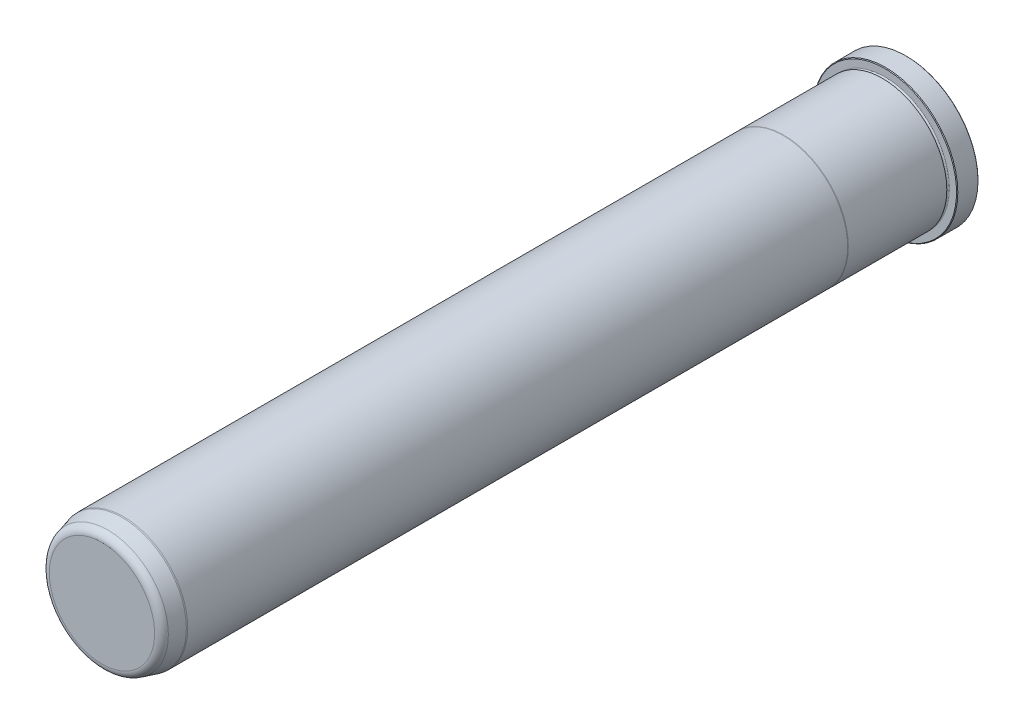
ISO-10303-21;
HEADER;
FILE_DESCRIPTION(('STEP AP214'),'2;1');
FILE_NAME('part.step','',(''),(''),'','','');
FILE_SCHEMA(('AUTOMOTIVE_DESIGN { 1 0 10303 214 1 1 1 1 }'));
ENDSEC;
DATA;
#1=APPLICATION_CONTEXT('core data for automotive mechanical design processes');
#2=APPLICATION_PROTOCOL_DEFINITION('international standard','automotive_design',2000,#1);
#3=PRODUCT_CONTEXT('',#1,'mechanical');
#4=PRODUCT('Part','Part','',(#3));
#5=PRODUCT_RELATED_PRODUCT_CATEGORY('part','',(#4));
#6=PRODUCT_DEFINITION_FORMATION('','',#4);
#7=PRODUCT_DEFINITION_CONTEXT('part definition',#1,'design');
#8=PRODUCT_DEFINITION('design','',#6,#7);
#9=PRODUCT_DEFINITION_SHAPE('','',#8);
#10=(LENGTH_UNIT() NAMED_UNIT(*) SI_UNIT(.MILLI.,.METRE.));
#11=(NAMED_UNIT(*) PLANE_ANGLE_UNIT() SI_UNIT($,.RADIAN.));
#12=(NAMED_UNIT(*) SI_UNIT($,.STERADIAN.) SOLID_ANGLE_UNIT());
#13=UNCERTAINTY_MEASURE_WITH_UNIT(LENGTH_MEASURE(1.E-05),#10,'distance_accuracy_value','');
#14=(GEOMETRIC_REPRESENTATION_CONTEXT(3) GLOBAL_UNCERTAINTY_ASSIGNED_CONTEXT((#13)) GLOBAL_UNIT_ASSIGNED_CONTEXT((#10,
#11,#12)) REPRESENTATION_CONTEXT('',''));
#15=CARTESIAN_POINT('',(0.,0.,0.));
#16=DIRECTION('',(0.,0.,1.));
#17=DIRECTION('',(1.,0.,0.));
#18=AXIS2_PLACEMENT_3D('',#15,#16,#17);
#19=CARTESIAN_POINT('',(0.,0.,0.));
#20=DIRECTION('',(0.,0.,1.));
#21=DIRECTION('',(1.,0.,0.));
#22=AXIS2_PLACEMENT_3D('',#19,#20,#21);
#23=PLANE('',#22);
#24=CARTESIAN_POINT('',(0.,0.,0.));
#25=DIRECTION('',(0.,0.,1.));
#26=DIRECTION('',(1.,0.,0.));
#27=AXIS2_PLACEMENT_3D('',#24,#25,#26);
#28=CIRCLE('',#27,42.3545000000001);
#29=CARTESIAN_POINT('',(42.3545000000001,0.,0.));
#30=VERTEX_POINT('',#29);
#31=EDGE_CURVE('E37',#30,#30,#28,.F.);
#32=ORIENTED_EDGE('',*,*,#31,.T.);
#33=EDGE_LOOP('',(#32));
#34=FACE_BOUND('',#33,.T.);
#35=ADVANCED_FACE('F30',(#34),#23,.F.);
#36=CARTESIAN_POINT('',(0.,0.,0.));
#37=DIRECTION('',(0.,0.,1.));
#38=DIRECTION('',(1.,0.,0.));
#39=AXIS2_PLACEMENT_3D('',#36,#37,#38);
#40=CYLINDRICAL_SURFACE('',#39,42.7355);
#41=CARTESIAN_POINT('',(0.,0.,0.380999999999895));
#42=DIRECTION('',(0.,0.,1.));
#43=DIRECTION('',(1.,0.,0.));
#44=AXIS2_PLACEMENT_3D('',#41,#42,#43);
#45=CIRCLE('',#44,42.7355);
#46=CARTESIAN_POINT('',(42.7355,0.,0.380999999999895));
#47=VERTEX_POINT('',#46);
#48=EDGE_CURVE('E41',#47,#47,#45,.T.);
#49=ORIENTED_EDGE('',*,*,#48,.T.);
#50=EDGE_LOOP('',(#49));
#51=FACE_BOUND('',#50,.T.);
#52=CARTESIAN_POINT('',(0.,0.,12.319));
#53=DIRECTION('',(0.,0.,-1.));
#54=DIRECTION('',(-1.,0.,0.));
#55=AXIS2_PLACEMENT_3D('',#52,#53,#54);
#56=CIRCLE('',#55,42.7355);
#57=CARTESIAN_POINT('',(-42.7355,0.,12.319));
#58=VERTEX_POINT('',#57);
#59=EDGE_CURVE('E45',#58,#58,#56,.T.);
#60=ORIENTED_EDGE('',*,*,#59,.T.);
#61=EDGE_LOOP('',(#60));
#62=FACE_BOUND('',#61,.T.);
#63=ADVANCED_FACE('F118',(#51,#62),#40,.T.);
#64=CARTESIAN_POINT('',(0.,42.7355,12.7));
#65=DIRECTION('',(0.,0.,-1.));
#66=DIRECTION('',(-1.,0.,0.));
#67=AXIS2_PLACEMENT_3D('',#64,#65,#66);
#68=PLANE('',#67);
#69=CARTESIAN_POINT('',(0.,0.,12.7));
#70=DIRECTION('',(0.,0.,-1.));
#71=DIRECTION('',(-1.,0.,0.));
#72=AXIS2_PLACEMENT_3D('',#69,#70,#71);
#73=CIRCLE('',#72,42.3545);
#74=CARTESIAN_POINT('',(-42.3545,0.,12.7));
#75=VERTEX_POINT('',#74);
#76=EDGE_CURVE('E10',#75,#75,#73,.F.);
#77=ORIENTED_EDGE('',*,*,#76,.T.);
#78=EDGE_LOOP('',(#77));
#79=FACE_BOUND('',#78,.T.);
#80=CARTESIAN_POINT('',(0.,0.,12.7));
#81=DIRECTION('',(0.,0.,1.));
#82=DIRECTION('',(1.,0.,0.));
#83=AXIS2_PLACEMENT_3D('',#80,#81,#82);
#84=CIRCLE('',#83,38.0873);
#85=CARTESIAN_POINT('',(38.0873,0.,12.7));
#86=VERTEX_POINT('',#85);
#87=EDGE_CURVE('E56',#86,#86,#84,.T.);
#88=ORIENTED_EDGE('',*,*,#87,.F.);
#89=EDGE_LOOP('',(#88));
#90=FACE_BOUND('',#89,.T.);
#91=ADVANCED_FACE('F113',(#79,#90),#68,.F.);
#92=CARTESIAN_POINT('',(0.,0.,13.462));
#93=DIRECTION('',(0.,0.,1.));
#94=DIRECTION('',(1.,0.,0.));
#95=AXIS2_PLACEMENT_3D('',#92,#93,#94);
#96=TOROIDAL_SURFACE('',#95,38.0873,0.762);
#97=CARTESIAN_POINT('',(0.,0.,14.224));
#98=DIRECTION('',(0.,0.,1.));
#99=DIRECTION('',(1.,0.,0.));
#100=AXIS2_PLACEMENT_3D('',#97,#98,#99);
#101=CIRCLE('',#100,38.0873);
#102=CARTESIAN_POINT('',(38.0873,0.,14.224));
#103=VERTEX_POINT('',#102);
#104=EDGE_CURVE('E59',#103,#103,#101,.T.);
#105=ORIENTED_EDGE('',*,*,#104,.F.);
#106=EDGE_LOOP('',(#105));
#107=FACE_BOUND('',#106,.T.);
#108=ORIENTED_EDGE('',*,*,#87,.T.);
#109=EDGE_LOOP('',(#108));
#110=FACE_BOUND('',#109,.T.);
#111=ADVANCED_FACE('F107',(#107,#110),#96,.F.);
#112=CARTESIAN_POINT('',(0.,38.0873,14.224));
#113=DIRECTION('',(0.,0.,1.));
#114=DIRECTION('',(1.,0.,0.));
#115=AXIS2_PLACEMENT_3D('',#112,#113,#114);
#116=PLANE('',#115);
#117=CARTESIAN_POINT('',(0.,0.,14.224));
#118=DIRECTION('',(0.,0.,1.));
#119=DIRECTION('',(1.,0.,0.));
#120=AXIS2_PLACEMENT_3D('',#117,#118,#119);
#121=CIRCLE('',#120,38.1127);
#122=CARTESIAN_POINT('',(38.1127,0.,14.224));
#123=VERTEX_POINT('',#122);
#124=EDGE_CURVE('E62',#123,#123,#121,.T.);
#125=ORIENTED_EDGE('',*,*,#124,.F.);
#126=EDGE_LOOP('',(#125));
#127=FACE_BOUND('',#126,.T.);
#128=ORIENTED_EDGE('',*,*,#104,.T.);
#129=EDGE_LOOP('',(#128));
#130=FACE_BOUND('',#129,.T.);
#131=ADVANCED_FACE('F101',(#127,#130),#116,.F.);
#132=CARTESIAN_POINT('',(0.,0.,0.));
#133=DIRECTION('',(0.,0.,1.));
#134=DIRECTION('',(1.,0.,0.));
#135=AXIS2_PLACEMENT_3D('',#132,#133,#134);
#136=CYLINDRICAL_SURFACE('',#135,38.1127);
#137=CARTESIAN_POINT('',(0.,0.,72.5347630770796));
#138=DIRECTION('',(0.,0.,1.));
#139=DIRECTION('',(1.,0.,0.));
#140=AXIS2_PLACEMENT_3D('',#137,#138,#139);
#141=CIRCLE('',#140,38.1127);
#142=CARTESIAN_POINT('',(38.1127,0.,72.5347630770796));
#143=VERTEX_POINT('',#142);
#144=EDGE_CURVE('E65',#143,#143,#141,.T.);
#145=ORIENTED_EDGE('',*,*,#144,.F.);
#146=EDGE_LOOP('',(#145));
#147=FACE_BOUND('',#146,.T.);
#148=ORIENTED_EDGE('',*,*,#124,.T.);
#149=EDGE_LOOP('',(#148));
#150=FACE_BOUND('',#149,.T.);
#151=ADVANCED_FACE('F95',(#147,#150),#136,.T.);
#152=CARTESIAN_POINT('',(0.,0.,72.5347630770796));
#153=DIRECTION('',(0.,0.,-1.));
#154=DIRECTION('',(-1.,0.,0.));
#155=AXIS2_PLACEMENT_3D('',#152,#153,#154);
#156=CONICAL_SURFACE('',#155,38.1127,0.0698131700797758);
#157=CARTESIAN_POINT('',(0.,0.,72.898));
#158=DIRECTION('',(0.,0.,1.));
#159=DIRECTION('',(1.,0.,0.));
#160=AXIS2_PLACEMENT_3D('',#157,#158,#159);
#161=CIRCLE('',#160,38.0873);
#162=CARTESIAN_POINT('',(38.0873,0.,72.898));
#163=VERTEX_POINT('',#162);
#164=EDGE_CURVE('E68',#163,#163,#161,.T.);
#165=ORIENTED_EDGE('',*,*,#164,.F.);
#166=EDGE_LOOP('',(#165));
#167=FACE_BOUND('',#166,.T.);
#168=ORIENTED_EDGE('',*,*,#144,.T.);
#169=EDGE_LOOP('',(#168));
#170=FACE_BOUND('',#169,.T.);
#171=ADVANCED_FACE('F89',(#167,#170),#156,.T.);
#172=CARTESIAN_POINT('',(0.,0.,0.));
#173=DIRECTION('',(0.,0.,1.));
#174=DIRECTION('',(1.,0.,0.));
#175=AXIS2_PLACEMENT_3D('',#172,#173,#174);
#176=CYLINDRICAL_SURFACE('',#175,38.0873);
#177=CARTESIAN_POINT('',(0.,0.,463.55));
#178=DIRECTION('',(0.,0.,1.));
#179=DIRECTION('',(1.,0.,0.));
#180=AXIS2_PLACEMENT_3D('',#177,#178,#179);
#181=CIRCLE('',#180,38.0872999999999);
#182=CARTESIAN_POINT('',(38.0872999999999,0.,463.55));
#183=VERTEX_POINT('',#182);
#184=EDGE_CURVE('E71',#183,#183,#181,.T.);
#185=ORIENTED_EDGE('',*,*,#184,.F.);
#186=EDGE_LOOP('',(#185));
#187=FACE_BOUND('',#186,.T.);
#188=ORIENTED_EDGE('',*,*,#164,.T.);
#189=EDGE_LOOP('',(#188));
#190=FACE_BOUND('',#189,.T.);
#191=ADVANCED_FACE('F83',(#187,#190),#176,.T.);
#192=CARTESIAN_POINT('',(0.,0.,463.55));
#193=DIRECTION('',(0.,0.,-1.));
#194=DIRECTION('',(-1.,0.,0.));
#195=AXIS2_PLACEMENT_3D('',#192,#193,#194);
#196=CONICAL_SURFACE('',#195,38.0872999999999,0.0872664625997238);
#197=CARTESIAN_POINT('',(0.,0.,464.312));
#198=DIRECTION('',(0.,0.,1.));
#199=DIRECTION('',(1.,0.,0.));
#200=AXIS2_PLACEMENT_3D('',#197,#198,#199);
#201=CIRCLE('',#200,38.0206336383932);
#202=CARTESIAN_POINT('',(38.0206336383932,0.,464.312));
#203=VERTEX_POINT('',#202);
#204=EDGE_CURVE('E74',#203,#203,#201,.T.);
#205=ORIENTED_EDGE('',*,*,#204,.F.);
#206=EDGE_LOOP('',(#205));
#207=FACE_BOUND('',#206,.T.);
#208=ORIENTED_EDGE('',*,*,#184,.T.);
#209=EDGE_LOOP('',(#208));
#210=FACE_BOUND('',#209,.T.);
#211=ADVANCED_FACE('F80',(#207,#210),#196,.T.);
#212=CARTESIAN_POINT('',(0.,0.,464.312));
#213=DIRECTION('',(0.,0.,-1.));
#214=DIRECTION('',(-1.,0.,0.));
#215=AXIS2_PLACEMENT_3D('',#212,#213,#214);
#216=CONICAL_SURFACE('',#215,38.0206336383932,0.26179938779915);
#217=CARTESIAN_POINT('',(0.,0.,472.720125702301));
#218=DIRECTION('',(0.,0.,1.));
#219=DIRECTION('',(1.,0.,0.));
#220=AXIS2_PLACEMENT_3D('',#217,#218,#219);
#221=CIRCLE('',#220,35.7676831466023);
#222=CARTESIAN_POINT('',(35.7676831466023,0.,472.720125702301));
#223=VERTEX_POINT('',#222);
#224=EDGE_CURVE('E50',#223,#223,#221,.F.);
#225=ORIENTED_EDGE('',*,*,#224,.T.);
#226=EDGE_LOOP('',(#225));
#227=FACE_BOUND('',#226,.T.);
#228=ORIENTED_EDGE('',*,*,#204,.T.);
#229=EDGE_LOOP('',(#228));
#230=FACE_BOUND('',#229,.T.);
#231=ADVANCED_FACE('F78',(#227,#230),#216,.T.);
#232=CARTESIAN_POINT('',(0.,34.8218561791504,476.25));
#233=DIRECTION('',(0.,0.,-1.));
#234=DIRECTION('',(-1.,0.,0.));
#235=AXIS2_PLACEMENT_3D('',#232,#233,#234);
#236=PLANE('',#235);
#237=CARTESIAN_POINT('',(0.,0.,476.25));
#238=DIRECTION('',(0.,0.,-1.));
#239=DIRECTION('',(-1.,0.,0.));
#240=AXIS2_PLACEMENT_3D('',#237,#238,#239);
#241=CIRCLE('',#240,31.1674613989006);
#242=CARTESIAN_POINT('',(-31.1674613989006,0.,476.25));
#243=VERTEX_POINT('',#242);
#244=EDGE_CURVE('E53',#243,#243,#241,.F.);
#245=ORIENTED_EDGE('',*,*,#244,.T.);
#246=EDGE_LOOP('',(#245));
#247=FACE_BOUND('',#246,.T.);
#248=ADVANCED_FACE('F133',(#247),#236,.F.);
#249=CARTESIAN_POINT('',(0.,0.,471.4875));
#250=DIRECTION('',(0.,0.,-1.));
#251=DIRECTION('',(-1.,0.,0.));
#252=AXIS2_PLACEMENT_3D('',#249,#250,#251);
#253=TOROIDAL_SURFACE('',#252,31.1674613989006,4.7625);
#254=ORIENTED_EDGE('',*,*,#224,.F.);
#255=EDGE_LOOP('',(#254));
#256=FACE_BOUND('',#255,.T.);
#257=ORIENTED_EDGE('',*,*,#244,.F.);
#258=EDGE_LOOP('',(#257));
#259=FACE_BOUND('',#258,.T.);
#260=ADVANCED_FACE('F130',(#256,#259),#253,.T.);
#261=CARTESIAN_POINT('',(0.,0.,0.380999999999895));
#262=DIRECTION('',(0.,0.,1.));
#263=DIRECTION('',(1.,0.,0.));
#264=AXIS2_PLACEMENT_3D('',#261,#262,#263);
#265=CONICAL_SURFACE('',#264,42.7355,0.785398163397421);
#266=ORIENTED_EDGE('',*,*,#31,.F.);
#267=EDGE_LOOP('',(#266));
#268=FACE_BOUND('',#267,.T.);
#269=ORIENTED_EDGE('',*,*,#48,.F.);
#270=EDGE_LOOP('',(#269));
#271=FACE_BOUND('',#270,.T.);
#272=ADVANCED_FACE('F132',(#268,#271),#265,.T.);
#273=CARTESIAN_POINT('',(0.,0.,12.7));
#274=DIRECTION('',(0.,0.,-1.));
#275=DIRECTION('',(-1.,0.,0.));
#276=AXIS2_PLACEMENT_3D('',#273,#274,#275);
#277=CONICAL_SURFACE('',#276,42.3545,0.785398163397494);
#278=CARTESIAN_POINT('',(-42.7355,0.,12.319));
#279=CARTESIAN_POINT('',(-42.73153125,0.,12.32296875));
#280=CARTESIAN_POINT('',(-42.7275625,0.,12.3269375));
#281=CARTESIAN_POINT('',(-42.719625,0.,12.334875));
#282=CARTESIAN_POINT('',(-42.71565625,0.,12.33884375));
#283=CARTESIAN_POINT('',(-42.70771875,0.,12.34678125));
#284=CARTESIAN_POINT('',(-42.70375,0.,12.35075));
#285=CARTESIAN_POINT('',(-42.6958125,0.,12.3586875));
#286=CARTESIAN_POINT('',(-42.69184375,0.,12.36265625));
#287=CARTESIAN_POINT('',(-42.68390625,0.,12.37059375));
#288=CARTESIAN_POINT('',(-42.6799375,0.,12.3745625));
#289=CARTESIAN_POINT('',(-42.672,0.,12.3825));
#290=CARTESIAN_POINT('',(-42.66803125,0.,12.38646875));
#291=CARTESIAN_POINT('',(-42.66009375,0.,12.39440625));
#292=CARTESIAN_POINT('',(-42.656125,0.,12.398375));
#293=CARTESIAN_POINT('',(-42.6481875,0.,12.4063125));
#294=CARTESIAN_POINT('',(-42.64421875,0.,12.41028125));
#295=CARTESIAN_POINT('',(-42.63628125,0.,12.41821875));
#296=CARTESIAN_POINT('',(-42.6323125,0.,12.4221875));
#297=CARTESIAN_POINT('',(-42.624375,0.,12.430125));
#298=CARTESIAN_POINT('',(-42.62040625,0.,12.43409375));
#299=CARTESIAN_POINT('',(-42.61246875,0.,12.44203125));
#300=CARTESIAN_POINT('',(-42.6085,0.,12.446));
#301=CARTESIAN_POINT('',(-42.6005625,0.,12.4539375));
#302=CARTESIAN_POINT('',(-42.59659375,0.,12.45790625));
#303=CARTESIAN_POINT('',(-42.58865625,0.,12.46584375));
#304=CARTESIAN_POINT('',(-42.5846875,0.,12.4698125));
#305=CARTESIAN_POINT('',(-42.57675,0.,12.47775));
#306=CARTESIAN_POINT('',(-42.57278125,0.,12.48171875));
#307=CARTESIAN_POINT('',(-42.56484375,0.,12.48965625));
#308=CARTESIAN_POINT('',(-42.560875,0.,12.493625));
#309=CARTESIAN_POINT('',(-42.5529375,0.,12.5015625));
#310=CARTESIAN_POINT('',(-42.54896875,0.,12.50553125));
#311=CARTESIAN_POINT('',(-42.54103125,0.,12.51346875));
#312=CARTESIAN_POINT('',(-42.5370625,0.,12.5174375));
#313=CARTESIAN_POINT('',(-42.529125,0.,12.525375));
#314=CARTESIAN_POINT('',(-42.52515625,0.,12.52934375));
#315=CARTESIAN_POINT('',(-42.51721875,0.,12.53728125));
#316=CARTESIAN_POINT('',(-42.51325,0.,12.54125));
#317=CARTESIAN_POINT('',(-42.5053125,0.,12.5491875));
#318=CARTESIAN_POINT('',(-42.50134375,0.,12.55315625));
#319=CARTESIAN_POINT('',(-42.49340625,0.,12.56109375));
#320=CARTESIAN_POINT('',(-42.4894375,0.,12.5650625));
#321=CARTESIAN_POINT('',(-42.4815,0.,12.573));
#322=CARTESIAN_POINT('',(-42.47753125,0.,12.57696875));
#323=CARTESIAN_POINT('',(-42.46959375,0.,12.58490625));
#324=CARTESIAN_POINT('',(-42.465625,0.,12.588875));
#325=CARTESIAN_POINT('',(-42.4576875,0.,12.5968125));
#326=CARTESIAN_POINT('',(-42.45371875,0.,12.60078125));
#327=CARTESIAN_POINT('',(-42.44578125,0.,12.60871875));
#328=CARTESIAN_POINT('',(-42.4418125,0.,12.6126875));
#329=CARTESIAN_POINT('',(-42.433875,0.,12.620625));
#330=CARTESIAN_POINT('',(-42.42990625,0.,12.62459375));
#331=CARTESIAN_POINT('',(-42.42196875,0.,12.63253125));
#332=CARTESIAN_POINT('',(-42.418,0.,12.6365));
#333=CARTESIAN_POINT('',(-42.4100625,0.,12.6444375));
#334=CARTESIAN_POINT('',(-42.40609375,0.,12.64840625));
#335=CARTESIAN_POINT('',(-42.39815625,0.,12.65634375));
#336=CARTESIAN_POINT('',(-42.3941875,0.,12.6603125));
#337=CARTESIAN_POINT('',(-42.38625,0.,12.66825));
#338=CARTESIAN_POINT('',(-42.38228125,0.,12.67221875));
#339=CARTESIAN_POINT('',(-42.37434375,0.,12.68015625));
#340=CARTESIAN_POINT('',(-42.370375,0.,12.684125));
#341=CARTESIAN_POINT('',(-42.3624375,0.,12.6920625));
#342=CARTESIAN_POINT('',(-42.35846875,0.,12.69603125));
#343=CARTESIAN_POINT('',(-42.3545,0.,12.7));
#344=B_SPLINE_CURVE_WITH_KNOTS('',3,(#278,#279,#280,#281,#282,#283,#284,#285,#286,#287,#288,
#289,#290,#291,#292,#293,#294,#295,#296,#297,#298,#299,#300,#301,#302,#303,#304,#305,#306,#307,
#308,#309,#310,#311,#312,#313,#314,#315,#316,#317,#318,#319,#320,#321,#322,#323,#324,#325,#326,
#327,#328,#329,#330,#331,#332,#333,#334,#335,#336,#337,#338,#339,#340,#341,#342,#343),
.UNSPECIFIED.,.F.,.F.,(4,2,2,2,2,2,2,2,2,2,2,2,2,2,2,2,2,2,2,2,2,2,2,2,2,2,2,2,2,2,2,2,4),(0.,
0.0168379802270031,0.0336759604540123,0.0505139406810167,0.067351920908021,0.084189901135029,
0.101027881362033,0.117865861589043,0.134703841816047,0.15154182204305,0.168379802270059,
0.185217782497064,0.202055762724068,0.218893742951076,0.23573172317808,0.252569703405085,
0.269407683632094,0.286245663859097,0.303083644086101,0.31992162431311,0.336759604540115,
0.353597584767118,0.370435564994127,0.387273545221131,0.404111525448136,0.420949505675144,
0.437787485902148,0.454625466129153,0.471463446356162,0.488301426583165,0.505139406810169,
0.521977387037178,0.538815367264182),.UNSPECIFIED.);
#345=EDGE_CURVE('BSEAM32',#58,#75,#344,.T.);
#346=ORIENTED_EDGE('',*,*,#59,.F.);
#347=ORIENTED_EDGE('',*,*,#76,.F.);
#348=ORIENTED_EDGE('',*,*,#345,.T.);
#349=ORIENTED_EDGE('',*,*,#345,.F.);
#350=EDGE_LOOP('',(#346,#348,#347,#349));
#351=FACE_BOUND('',#350,.T.);
#352=ADVANCED_FACE('F32',(#351),#277,.T.);
#353=CLOSED_SHELL('',(#35,#63,#91,#111,#131,#151,#171,#191,#211,#231,#248,#260,#272,#352));
#354=MANIFOLD_SOLID_BREP('B2',#353);
#355=ADVANCED_BREP_SHAPE_REPRESENTATION('',(#18,#354),#14);
#356=SHAPE_DEFINITION_REPRESENTATION(#9,#355);
ENDSEC;
END-ISO-10303-21;
